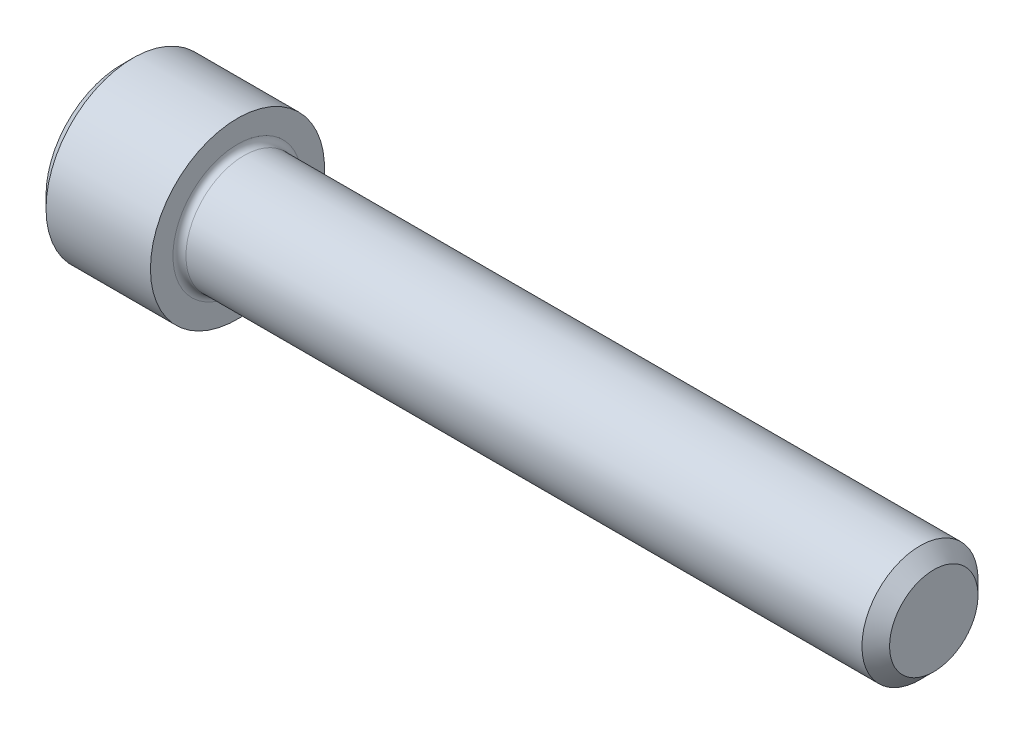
ISO-10303-21;
HEADER;
FILE_DESCRIPTION(('STEP AP214'),'2;1');
FILE_NAME('part.step','',(''),(''),'','','');
FILE_SCHEMA(('AUTOMOTIVE_DESIGN { 1 0 10303 214 1 1 1 1 }'));
ENDSEC;
DATA;
#1=APPLICATION_CONTEXT('core data for automotive mechanical design processes');
#2=APPLICATION_PROTOCOL_DEFINITION('international standard','automotive_design',2000,#1);
#3=PRODUCT_CONTEXT('',#1,'mechanical');
#4=PRODUCT('Part','Part','',(#3));
#5=PRODUCT_RELATED_PRODUCT_CATEGORY('part','',(#4));
#6=PRODUCT_DEFINITION_FORMATION('','',#4);
#7=PRODUCT_DEFINITION_CONTEXT('part definition',#1,'design');
#8=PRODUCT_DEFINITION('design','',#6,#7);
#9=PRODUCT_DEFINITION_SHAPE('','',#8);
#10=(LENGTH_UNIT() NAMED_UNIT(*) SI_UNIT(.MILLI.,.METRE.));
#11=(NAMED_UNIT(*) PLANE_ANGLE_UNIT() SI_UNIT($,.RADIAN.));
#12=(NAMED_UNIT(*) SI_UNIT($,.STERADIAN.) SOLID_ANGLE_UNIT());
#13=UNCERTAINTY_MEASURE_WITH_UNIT(LENGTH_MEASURE(1.E-05),#10,'distance_accuracy_value','');
#14=(GEOMETRIC_REPRESENTATION_CONTEXT(3) GLOBAL_UNCERTAINTY_ASSIGNED_CONTEXT((#13)) GLOBAL_UNIT_ASSIGNED_CONTEXT((#10,
#11,#12)) REPRESENTATION_CONTEXT('',''));
#15=CARTESIAN_POINT('',(0.,0.,0.));
#16=DIRECTION('',(0.,0.,1.));
#17=DIRECTION('',(1.,0.,0.));
#18=AXIS2_PLACEMENT_3D('',#15,#16,#17);
#19=CARTESIAN_POINT('',(0.,0.,0.));
#20=DIRECTION('',(-1.,0.,0.));
#21=DIRECTION('',(0.,0.,1.));
#22=AXIS2_PLACEMENT_3D('',#19,#20,#21);
#23=PLANE('',#22);
#24=DIRECTION('',(0.,-0.499999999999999,0.866025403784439));
#25=VECTOR('',#24,1.);
#26=CARTESIAN_POINT('',(0.,2.7496306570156,0.));
#27=LINE('',#26,#25);
#28=CARTESIAN_POINT('',(0.,2.7496306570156,0.));
#29=VERTEX_POINT('',#28);
#30=CARTESIAN_POINT('',(0.,1.3748153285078,2.38125));
#31=VERTEX_POINT('',#30);
#32=EDGE_CURVE('E372',#29,#31,#27,.T.);
#33=ORIENTED_EDGE('',*,*,#32,.T.);
#34=DIRECTION('',(0.,1.,0.));
#35=VECTOR('',#34,1.);
#36=CARTESIAN_POINT('',(0.,-1.37481532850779,2.38125));
#37=LINE('',#36,#35);
#38=CARTESIAN_POINT('',(0.,-1.37481532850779,2.38125));
#39=VERTEX_POINT('',#38);
#40=EDGE_CURVE('E128',#39,#31,#37,.T.);
#41=ORIENTED_EDGE('',*,*,#40,.F.);
#42=DIRECTION('',(0.,-0.500000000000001,-0.866025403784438));
#43=VECTOR('',#42,1.);
#44=CARTESIAN_POINT('',(0.,-1.37481532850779,2.38125));
#45=LINE('',#44,#43);
#46=CARTESIAN_POINT('',(0.,-2.74963065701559,0.));
#47=VERTEX_POINT('',#46);
#48=EDGE_CURVE('E375',#39,#47,#45,.T.);
#49=ORIENTED_EDGE('',*,*,#48,.T.);
#50=DIRECTION('',(0.,0.499999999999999,-0.866025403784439));
#51=VECTOR('',#50,1.);
#52=CARTESIAN_POINT('',(0.,-2.74963065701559,0.));
#53=LINE('',#52,#51);
#54=CARTESIAN_POINT('',(0.,-1.3748153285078,-2.38125));
#55=VERTEX_POINT('',#54);
#56=EDGE_CURVE('E378',#47,#55,#53,.T.);
#57=ORIENTED_EDGE('',*,*,#56,.T.);
#58=DIRECTION('',(0.,-1.,0.));
#59=VECTOR('',#58,1.);
#60=CARTESIAN_POINT('',(0.,1.3748153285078,-2.38125));
#61=LINE('',#60,#59);
#62=CARTESIAN_POINT('',(0.,1.3748153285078,-2.38125));
#63=VERTEX_POINT('',#62);
#64=EDGE_CURVE('E381',#63,#55,#61,.T.);
#65=ORIENTED_EDGE('',*,*,#64,.F.);
#66=DIRECTION('',(0.,-0.500000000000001,-0.866025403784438));
#67=VECTOR('',#66,1.);
#68=CARTESIAN_POINT('',(0.,2.7496306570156,0.));
#69=LINE('',#68,#67);
#70=EDGE_CURVE('E123',#29,#63,#69,.T.);
#71=ORIENTED_EDGE('',*,*,#70,.F.);
#72=EDGE_LOOP('',(#33,#41,#49,#57,#65,#71));
#73=FACE_BOUND('',#72,.T.);
#74=CARTESIAN_POINT('',(0.,0.,0.));
#75=DIRECTION('',(-1.,0.,0.));
#76=DIRECTION('',(0.,0.,1.));
#77=AXIS2_PLACEMENT_3D('',#74,#75,#76);
#78=CIRCLE('',#77,4.12750000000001);
#79=CARTESIAN_POINT('',(0.,0.,4.12750000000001));
#80=VERTEX_POINT('',#79);
#81=EDGE_CURVE('E139',#80,#80,#78,.T.);
#82=ORIENTED_EDGE('',*,*,#81,.T.);
#83=EDGE_LOOP('',(#82));
#84=FACE_BOUND('',#83,.T.);
#85=ADVANCED_FACE('F32',(#73,#84),#23,.T.);
#86=CARTESIAN_POINT('',(44.45,2.41935,0.));
#87=DIRECTION('',(1.,0.,0.));
#88=DIRECTION('',(0.,0.,-1.));
#89=AXIS2_PLACEMENT_3D('',#86,#87,#88);
#90=PLANE('',#89);
#91=CARTESIAN_POINT('',(44.45,0.,0.));
#92=DIRECTION('',(-1.,0.,0.));
#93=DIRECTION('',(0.,0.,1.));
#94=AXIS2_PLACEMENT_3D('',#91,#92,#93);
#95=CIRCLE('',#94,2.41935);
#96=CARTESIAN_POINT('',(44.45,0.,2.41935));
#97=VERTEX_POINT('',#96);
#98=EDGE_CURVE('E152',#97,#97,#95,.T.);
#99=ORIENTED_EDGE('',*,*,#98,.F.);
#100=EDGE_LOOP('',(#99));
#101=FACE_BOUND('',#100,.T.);
#102=ADVANCED_FACE('F173',(#101),#90,.T.);
#103=CARTESIAN_POINT('',(44.45,0.,0.));
#104=DIRECTION('',(-1.,0.,0.));
#105=DIRECTION('',(0.,0.,1.));
#106=AXIS2_PLACEMENT_3D('',#103,#104,#105);
#107=CONICAL_SURFACE('',#106,2.41935,0.78539816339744);
#108=CARTESIAN_POINT('',(43.69435,0.,0.));
#109=DIRECTION('',(-1.,0.,0.));
#110=DIRECTION('',(0.,0.,1.));
#111=AXIS2_PLACEMENT_3D('',#108,#109,#110);
#112=CIRCLE('',#111,3.175);
#113=CARTESIAN_POINT('',(43.69435,0.,3.175));
#114=VERTEX_POINT('',#113);
#115=EDGE_CURVE('E149',#114,#114,#112,.T.);
#116=ORIENTED_EDGE('',*,*,#115,.F.);
#117=EDGE_LOOP('',(#116));
#118=FACE_BOUND('',#117,.T.);
#119=ORIENTED_EDGE('',*,*,#98,.T.);
#120=EDGE_LOOP('',(#119));
#121=FACE_BOUND('',#120,.T.);
#122=ADVANCED_FACE('F179',(#118,#121),#107,.T.);
#123=CARTESIAN_POINT('',(-31.75,0.,0.));
#124=DIRECTION('',(-1.,0.,0.));
#125=DIRECTION('',(0.,0.,1.));
#126=AXIS2_PLACEMENT_3D('',#123,#124,#125);
#127=CYLINDRICAL_SURFACE('',#126,3.175);
#128=CARTESIAN_POINT('',(6.70560000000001,0.,0.));
#129=DIRECTION('',(1.,0.,0.));
#130=DIRECTION('',(0.,0.,-1.));
#131=AXIS2_PLACEMENT_3D('',#128,#129,#130);
#132=CIRCLE('',#131,3.175);
#133=CARTESIAN_POINT('',(6.70560000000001,0.,-3.175));
#134=VERTEX_POINT('',#133);
#135=EDGE_CURVE('E11',#134,#134,#132,.T.);
#136=ORIENTED_EDGE('',*,*,#135,.T.);
#137=EDGE_LOOP('',(#136));
#138=FACE_BOUND('',#137,.T.);
#139=ORIENTED_EDGE('',*,*,#115,.T.);
#140=EDGE_LOOP('',(#139));
#141=FACE_BOUND('',#140,.T.);
#142=ADVANCED_FACE('F190',(#138,#141),#127,.T.);
#143=CARTESIAN_POINT('',(6.35,4.7625,0.));
#144=DIRECTION('',(1.,0.,0.));
#145=DIRECTION('',(0.,0.,-1.));
#146=AXIS2_PLACEMENT_3D('',#143,#144,#145);
#147=PLANE('',#146);
#148=CARTESIAN_POINT('',(6.35,0.,0.));
#149=DIRECTION('',(1.,0.,0.));
#150=DIRECTION('',(0.,0.,-1.));
#151=AXIS2_PLACEMENT_3D('',#148,#149,#150);
#152=CIRCLE('',#151,3.5306);
#153=CARTESIAN_POINT('',(6.35,0.,-3.5306));
#154=VERTEX_POINT('',#153);
#155=EDGE_CURVE('E40',#154,#154,#152,.F.);
#156=ORIENTED_EDGE('',*,*,#155,.T.);
#157=EDGE_LOOP('',(#156));
#158=FACE_BOUND('',#157,.T.);
#159=CARTESIAN_POINT('',(6.35,0.,0.));
#160=DIRECTION('',(-1.,0.,0.));
#161=DIRECTION('',(0.,0.,1.));
#162=AXIS2_PLACEMENT_3D('',#159,#160,#161);
#163=CIRCLE('',#162,4.7625);
#164=CARTESIAN_POINT('',(6.35,0.,4.7625));
#165=VERTEX_POINT('',#164);
#166=EDGE_CURVE('E146',#165,#165,#163,.T.);
#167=ORIENTED_EDGE('',*,*,#166,.F.);
#168=EDGE_LOOP('',(#167));
#169=FACE_BOUND('',#168,.T.);
#170=ADVANCED_FACE('F157',(#158,#169),#147,.T.);
#171=CARTESIAN_POINT('',(-31.75,0.,0.));
#172=DIRECTION('',(-1.,0.,0.));
#173=DIRECTION('',(0.,0.,1.));
#174=AXIS2_PLACEMENT_3D('',#171,#172,#173);
#175=CYLINDRICAL_SURFACE('',#174,4.7625);
#176=ORIENTED_EDGE('',*,*,#166,.T.);
#177=EDGE_LOOP('',(#176));
#178=FACE_BOUND('',#177,.T.);
#179=CARTESIAN_POINT('',(0.635000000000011,0.,0.));
#180=DIRECTION('',(-1.,0.,0.));
#181=DIRECTION('',(0.,0.,1.));
#182=AXIS2_PLACEMENT_3D('',#179,#180,#181);
#183=CIRCLE('',#182,4.7625);
#184=CARTESIAN_POINT('',(0.635000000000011,0.,4.7625));
#185=VERTEX_POINT('',#184);
#186=EDGE_CURVE('E143',#185,#185,#183,.T.);
#187=ORIENTED_EDGE('',*,*,#186,.F.);
#188=EDGE_LOOP('',(#187));
#189=FACE_BOUND('',#188,.T.);
#190=ADVANCED_FACE('F168',(#178,#189),#175,.T.);
#191=CARTESIAN_POINT('',(0.,0.,0.));
#192=DIRECTION('',(1.,0.,0.));
#193=DIRECTION('',(0.,0.,-1.));
#194=AXIS2_PLACEMENT_3D('',#191,#192,#193);
#195=CONICAL_SURFACE('',#194,4.12750000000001,0.785398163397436);
#196=ORIENTED_EDGE('',*,*,#186,.T.);
#197=EDGE_LOOP('',(#196));
#198=FACE_BOUND('',#197,.T.);
#199=ORIENTED_EDGE('',*,*,#81,.F.);
#200=EDGE_LOOP('',(#199));
#201=FACE_BOUND('',#200,.T.);
#202=ADVANCED_FACE('F161',(#198,#201),#195,.T.);
#203=CARTESIAN_POINT('',(6.70560000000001,0.,0.));
#204=DIRECTION('',(1.,0.,0.));
#205=DIRECTION('',(0.,0.,-1.));
#206=AXIS2_PLACEMENT_3D('',#203,#204,#205);
#207=TOROIDAL_SURFACE('',#206,3.5306,0.3556);
#208=ORIENTED_EDGE('',*,*,#135,.F.);
#209=EDGE_LOOP('',(#208));
#210=FACE_BOUND('',#209,.T.);
#211=ORIENTED_EDGE('',*,*,#155,.F.);
#212=EDGE_LOOP('',(#211));
#213=FACE_BOUND('',#212,.T.);
#214=ADVANCED_FACE('F34',(#210,#213),#207,.F.);
#215=CARTESIAN_POINT('',(3.048,2.7496306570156,0.));
#216=DIRECTION('',(0.,-0.866025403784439,-0.499999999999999));
#217=DIRECTION('',(0.,0.499999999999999,-0.866025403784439));
#218=AXIS2_PLACEMENT_3D('',#215,#216,#217);
#219=PLANE('',#218);
#220=ORIENTED_EDGE('',*,*,#32,.F.);
#221=DIRECTION('',(-1.,0.,0.));
#222=VECTOR('',#221,1.);
#223=CARTESIAN_POINT('',(3.048,2.7496306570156,0.));
#224=LINE('',#223,#222);
#225=CARTESIAN_POINT('',(3.048,2.7496306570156,0.));
#226=VERTEX_POINT('',#225);
#227=EDGE_CURVE('E362',#226,#29,#224,.T.);
#228=ORIENTED_EDGE('',*,*,#227,.F.);
#229=DIRECTION('',(0.,-0.499999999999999,0.866025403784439));
#230=VECTOR('',#229,1.);
#231=CARTESIAN_POINT('',(3.048,2.7496306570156,0.));
#232=LINE('',#231,#230);
#233=CARTESIAN_POINT('',(3.048,2.0622229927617,1.190625));
#234=VERTEX_POINT('',#233);
#235=EDGE_CURVE('E115',#226,#234,#232,.T.);
#236=ORIENTED_EDGE('',*,*,#235,.T.);
#237=CARTESIAN_POINT('',(3.048,1.3748153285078,2.38125));
#238=VERTEX_POINT('',#237);
#239=EDGE_CURVE('E106',#234,#238,#232,.T.);
#240=ORIENTED_EDGE('',*,*,#239,.T.);
#241=DIRECTION('',(-1.,0.,0.));
#242=VECTOR('',#241,1.);
#243=CARTESIAN_POINT('',(3.048,1.3748153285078,2.38125));
#244=LINE('',#243,#242);
#245=EDGE_CURVE('E120',#238,#31,#244,.T.);
#246=ORIENTED_EDGE('',*,*,#245,.T.);
#247=EDGE_LOOP('',(#220,#228,#236,#240,#246));
#248=FACE_BOUND('',#247,.T.);
#249=ADVANCED_FACE('F119',(#248),#219,.T.);
#250=CARTESIAN_POINT('',(3.048,-1.37481532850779,2.38125));
#251=DIRECTION('',(0.,0.,1.));
#252=DIRECTION('',(0.,-1.,0.));
#253=AXIS2_PLACEMENT_3D('',#250,#251,#252);
#254=PLANE('',#253);
#255=ORIENTED_EDGE('',*,*,#40,.T.);
#256=ORIENTED_EDGE('',*,*,#245,.F.);
#257=DIRECTION('',(0.,1.,0.));
#258=VECTOR('',#257,1.);
#259=CARTESIAN_POINT('',(3.048,-1.37481532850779,2.38125));
#260=LINE('',#259,#258);
#261=CARTESIAN_POINT('',(3.048,0.,2.38125));
#262=VERTEX_POINT('',#261);
#263=EDGE_CURVE('E103',#262,#238,#260,.T.);
#264=ORIENTED_EDGE('',*,*,#263,.F.);
#265=CARTESIAN_POINT('',(3.048,-1.37481532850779,2.38125));
#266=VERTEX_POINT('',#265);
#267=EDGE_CURVE('E114',#266,#262,#260,.T.);
#268=ORIENTED_EDGE('',*,*,#267,.F.);
#269=DIRECTION('',(-1.,0.,0.));
#270=VECTOR('',#269,1.);
#271=CARTESIAN_POINT('',(3.048,-1.37481532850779,2.38125));
#272=LINE('',#271,#270);
#273=EDGE_CURVE('E130',#266,#39,#272,.T.);
#274=ORIENTED_EDGE('',*,*,#273,.T.);
#275=EDGE_LOOP('',(#255,#256,#264,#268,#274));
#276=FACE_BOUND('',#275,.T.);
#277=ADVANCED_FACE('F125',(#276),#254,.F.);
#278=CARTESIAN_POINT('',(3.048,-1.37481532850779,2.38125));
#279=DIRECTION('',(0.,0.866025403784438,-0.500000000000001));
#280=DIRECTION('',(0.,0.500000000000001,0.866025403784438));
#281=AXIS2_PLACEMENT_3D('',#278,#279,#280);
#282=PLANE('',#281);
#283=ORIENTED_EDGE('',*,*,#48,.F.);
#284=ORIENTED_EDGE('',*,*,#273,.F.);
#285=DIRECTION('',(0.,-0.500000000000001,-0.866025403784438));
#286=VECTOR('',#285,1.);
#287=CARTESIAN_POINT('',(3.048,-1.37481532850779,2.38125));
#288=LINE('',#287,#286);
#289=CARTESIAN_POINT('',(3.048,-2.06222299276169,1.190625));
#290=VERTEX_POINT('',#289);
#291=EDGE_CURVE('E401',#266,#290,#288,.T.);
#292=ORIENTED_EDGE('',*,*,#291,.T.);
#293=CARTESIAN_POINT('',(3.048,-2.74963065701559,0.));
#294=VERTEX_POINT('',#293);
#295=EDGE_CURVE('E390',#290,#294,#288,.T.);
#296=ORIENTED_EDGE('',*,*,#295,.T.);
#297=DIRECTION('',(-1.,0.,0.));
#298=VECTOR('',#297,1.);
#299=CARTESIAN_POINT('',(3.048,-2.74963065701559,0.));
#300=LINE('',#299,#298);
#301=EDGE_CURVE('E135',#294,#47,#300,.T.);
#302=ORIENTED_EDGE('',*,*,#301,.T.);
#303=EDGE_LOOP('',(#283,#284,#292,#296,#302));
#304=FACE_BOUND('',#303,.T.);
#305=ADVANCED_FACE('F253',(#304),#282,.T.);
#306=CARTESIAN_POINT('',(3.048,-2.74963065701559,0.));
#307=DIRECTION('',(0.,0.866025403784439,0.499999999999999));
#308=DIRECTION('',(0.,-0.499999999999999,0.86602540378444));
#309=AXIS2_PLACEMENT_3D('',#306,#307,#308);
#310=PLANE('',#309);
#311=ORIENTED_EDGE('',*,*,#56,.F.);
#312=ORIENTED_EDGE('',*,*,#301,.F.);
#313=DIRECTION('',(0.,0.499999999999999,-0.866025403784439));
#314=VECTOR('',#313,1.);
#315=CARTESIAN_POINT('',(3.048,-2.74963065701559,0.));
#316=LINE('',#315,#314);
#317=CARTESIAN_POINT('',(3.048,-2.06222299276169,-1.190625));
#318=VERTEX_POINT('',#317);
#319=EDGE_CURVE('E368',#294,#318,#316,.T.);
#320=ORIENTED_EDGE('',*,*,#319,.T.);
#321=CARTESIAN_POINT('',(3.048,-1.3748153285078,-2.38125));
#322=VERTEX_POINT('',#321);
#323=EDGE_CURVE('E400',#318,#322,#316,.T.);
#324=ORIENTED_EDGE('',*,*,#323,.T.);
#325=DIRECTION('',(-1.,0.,0.));
#326=VECTOR('',#325,1.);
#327=CARTESIAN_POINT('',(3.048,-1.3748153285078,-2.38125));
#328=LINE('',#327,#326);
#329=EDGE_CURVE('E361',#322,#55,#328,.T.);
#330=ORIENTED_EDGE('',*,*,#329,.T.);
#331=EDGE_LOOP('',(#311,#312,#320,#324,#330));
#332=FACE_BOUND('',#331,.T.);
#333=ADVANCED_FACE('F261',(#332),#310,.T.);
#334=CARTESIAN_POINT('',(3.048,1.3748153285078,-2.38125));
#335=DIRECTION('',(0.,0.,-1.));
#336=DIRECTION('',(0.,1.,0.));
#337=AXIS2_PLACEMENT_3D('',#334,#335,#336);
#338=PLANE('',#337);
#339=ORIENTED_EDGE('',*,*,#64,.T.);
#340=ORIENTED_EDGE('',*,*,#329,.F.);
#341=DIRECTION('',(0.,-1.,0.));
#342=VECTOR('',#341,1.);
#343=CARTESIAN_POINT('',(3.048,1.3748153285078,-2.38125));
#344=LINE('',#343,#342);
#345=CARTESIAN_POINT('',(3.048,0.,-2.38125));
#346=VERTEX_POINT('',#345);
#347=EDGE_CURVE('E365',#346,#322,#344,.T.);
#348=ORIENTED_EDGE('',*,*,#347,.F.);
#349=CARTESIAN_POINT('',(3.048,1.3748153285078,-2.38125));
#350=VERTEX_POINT('',#349);
#351=EDGE_CURVE('E47',#350,#346,#344,.T.);
#352=ORIENTED_EDGE('',*,*,#351,.F.);
#353=DIRECTION('',(-1.,0.,0.));
#354=VECTOR('',#353,1.);
#355=CARTESIAN_POINT('',(3.048,1.3748153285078,-2.38125));
#356=LINE('',#355,#354);
#357=EDGE_CURVE('E358',#350,#63,#356,.T.);
#358=ORIENTED_EDGE('',*,*,#357,.T.);
#359=EDGE_LOOP('',(#339,#340,#348,#352,#358));
#360=FACE_BOUND('',#359,.T.);
#361=ADVANCED_FACE('F270',(#360),#338,.F.);
#362=CARTESIAN_POINT('',(3.048,2.7496306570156,0.));
#363=DIRECTION('',(0.,0.866025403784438,-0.500000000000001));
#364=DIRECTION('',(0.,0.500000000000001,0.866025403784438));
#365=AXIS2_PLACEMENT_3D('',#362,#363,#364);
#366=PLANE('',#365);
#367=ORIENTED_EDGE('',*,*,#70,.T.);
#368=ORIENTED_EDGE('',*,*,#357,.F.);
#369=DIRECTION('',(0.,-0.500000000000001,-0.866025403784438));
#370=VECTOR('',#369,1.);
#371=CARTESIAN_POINT('',(3.048,2.7496306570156,0.));
#372=LINE('',#371,#370);
#373=CARTESIAN_POINT('',(3.048,2.0622229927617,-1.190625));
#374=VERTEX_POINT('',#373);
#375=EDGE_CURVE('E348',#374,#350,#372,.T.);
#376=ORIENTED_EDGE('',*,*,#375,.F.);
#377=EDGE_CURVE('E354',#226,#374,#372,.T.);
#378=ORIENTED_EDGE('',*,*,#377,.F.);
#379=ORIENTED_EDGE('',*,*,#227,.T.);
#380=EDGE_LOOP('',(#367,#368,#376,#378,#379));
#381=FACE_BOUND('',#380,.T.);
#382=ADVANCED_FACE('F279',(#381),#366,.F.);
#383=CARTESIAN_POINT('',(3.048,4.12444598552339,-2.38125000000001));
#384=DIRECTION('',(1.,0.,0.));
#385=DIRECTION('',(0.,0.,-1.));
#386=AXIS2_PLACEMENT_3D('',#383,#384,#385);
#387=PLANE('',#386);
#388=ORIENTED_EDGE('',*,*,#347,.T.);
#389=ORIENTED_EDGE('',*,*,#323,.F.);
#390=CARTESIAN_POINT('',(3.048,0.,0.));
#391=DIRECTION('',(-1.,0.,0.));
#392=DIRECTION('',(0.,0.,1.));
#393=AXIS2_PLACEMENT_3D('',#390,#391,#392);
#394=CIRCLE('',#393,2.38125);
#395=EDGE_CURVE('E396',#346,#318,#394,.T.);
#396=ORIENTED_EDGE('',*,*,#395,.F.);
#397=EDGE_LOOP('',(#388,#389,#396));
#398=FACE_BOUND('',#397,.T.);
#399=ADVANCED_FACE('F288',(#398),#387,.F.);
#400=ORIENTED_EDGE('',*,*,#319,.F.);
#401=ORIENTED_EDGE('',*,*,#295,.F.);
#402=EDGE_CURVE('E133',#318,#290,#394,.T.);
#403=ORIENTED_EDGE('',*,*,#402,.F.);
#404=EDGE_LOOP('',(#400,#401,#403));
#405=FACE_BOUND('',#404,.T.);
#406=ADVANCED_FACE('F297',(#405),#387,.F.);
#407=ORIENTED_EDGE('',*,*,#291,.F.);
#408=ORIENTED_EDGE('',*,*,#267,.T.);
#409=EDGE_CURVE('E129',#290,#262,#394,.T.);
#410=ORIENTED_EDGE('',*,*,#409,.F.);
#411=EDGE_LOOP('',(#407,#408,#410));
#412=FACE_BOUND('',#411,.T.);
#413=ADVANCED_FACE('F306',(#412),#387,.F.);
#414=ORIENTED_EDGE('',*,*,#263,.T.);
#415=ORIENTED_EDGE('',*,*,#239,.F.);
#416=EDGE_CURVE('E109',#262,#234,#394,.T.);
#417=ORIENTED_EDGE('',*,*,#416,.F.);
#418=EDGE_LOOP('',(#414,#415,#417));
#419=FACE_BOUND('',#418,.T.);
#420=ADVANCED_FACE('F105',(#419),#387,.F.);
#421=ORIENTED_EDGE('',*,*,#235,.F.);
#422=ORIENTED_EDGE('',*,*,#377,.T.);
#423=EDGE_CURVE('E140',#234,#374,#394,.T.);
#424=ORIENTED_EDGE('',*,*,#423,.F.);
#425=EDGE_LOOP('',(#421,#422,#424));
#426=FACE_BOUND('',#425,.T.);
#427=ADVANCED_FACE('F321',(#426),#387,.F.);
#428=ORIENTED_EDGE('',*,*,#375,.T.);
#429=ORIENTED_EDGE('',*,*,#351,.T.);
#430=EDGE_CURVE('E351',#374,#346,#394,.T.);
#431=ORIENTED_EDGE('',*,*,#430,.F.);
#432=EDGE_LOOP('',(#428,#429,#431));
#433=FACE_BOUND('',#432,.T.);
#434=ADVANCED_FACE('F236',(#433),#387,.F.);
#435=CARTESIAN_POINT('',(3.048,0.,0.));
#436=DIRECTION('',(-1.,0.,0.));
#437=DIRECTION('',(0.,0.,1.));
#438=AXIS2_PLACEMENT_3D('',#435,#436,#437);
#439=CONICAL_SURFACE('',#438,2.38125,1.04719755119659);
#440=CARTESIAN_POINT('',(4.42281532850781,0.,0.));
#441=VERTEX_POINT('',#440);
#442=VERTEX_LOOP('',#441);
#443=FACE_BOUND('',#442,.T.);
#444=ORIENTED_EDGE('',*,*,#416,.T.);
#445=ORIENTED_EDGE('',*,*,#423,.T.);
#446=ORIENTED_EDGE('',*,*,#430,.T.);
#447=ORIENTED_EDGE('',*,*,#395,.T.);
#448=ORIENTED_EDGE('',*,*,#402,.T.);
#449=ORIENTED_EDGE('',*,*,#409,.T.);
#450=EDGE_LOOP('',(#444,#445,#446,#447,#448,#449));
#451=FACE_BOUND('',#450,.T.);
#452=ADVANCED_FACE('F183',(#443,#451),#439,.F.);
#453=CLOSED_SHELL('',(#85,#102,#122,#142,#170,#190,#202,#214,#249,#277,#305,#333,#361,#382,#399,
#406,#413,#420,#427,#434,#452));
#454=MANIFOLD_SOLID_BREP('B2',#453);
#455=ADVANCED_BREP_SHAPE_REPRESENTATION('',(#18,#454),#14);
#456=SHAPE_DEFINITION_REPRESENTATION(#9,#455);
ENDSEC;
END-ISO-10303-21;
